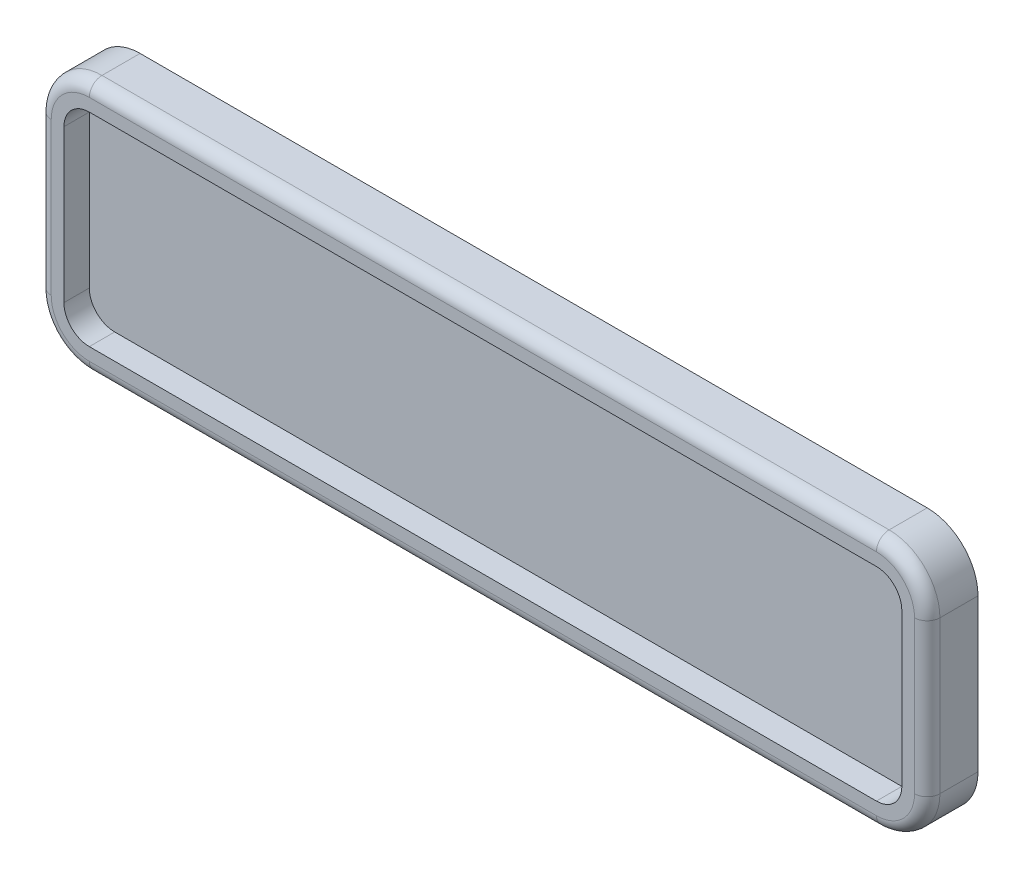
from build123d import *

# Parameters (mm, degrees)
BOSS_EXTRUDE1_DEPTH = 2
CUT_EXTRUDE2_DEPTH  = 1
FILLET3_R           = 0.5


with BuildPart() as part:
    # Sketch1 → Boss-Extrude1 (new body)
    with BuildSketch(Plane.XY):
        with BuildLine():
            Line((2, 0), (33, 0))
            ThreePointArc((33, 0), (34.414213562, 0.585786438), (35, 2))
            Line((35, 2), (35, 8))
            ThreePointArc((35, 8), (34.414213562, 9.414213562), (33, 10))
            Line((33, 10), (2, 10))
            ThreePointArc((2, 10), (0.585786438, 9.414213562), (0, 8))
            Line((0, 8), (0, 2))
            ThreePointArc((0, 2), (0.585786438, 0.585786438), (2, 0))
        make_face()
    extrude(amount=BOSS_EXTRUDE1_DEPTH)

    # Sketch2 → Cut-Extrude2 (cut)
    with BuildSketch(Plane.XY.offset(2)):
        with BuildLine():
            Line((33, 9), (2, 9))
            ThreePointArc((2, 9), (1.292893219, 8.707106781), (1, 8))
            Line((1, 8), (1, 2))
            ThreePointArc((1, 2), (1.292893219, 1.292893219), (2, 1))
            Line((2, 1), (33, 1))
            ThreePointArc((33, 1), (33.707106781, 1.292893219), (34, 2))
            Line((34, 2), (34, 8))
            ThreePointArc((34, 8), (33.707106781, 8.707106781), (33, 9))
        make_face()
    extrude(amount=-CUT_EXTRUDE2_DEPTH, mode=Mode.SUBTRACT)

    # Fillet3
    fillet3_edges = [part.edges().sort_by_distance(p)[0] for p in [
        (0.585786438, 9.414213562, 2),
        (0, 5, 2),
        (0.585786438, 0.585786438, 2),
        (17.5, 0, 2),
        (34.414213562, 0.585786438, 2),
        (35, 5, 2),
        (34.414213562, 9.414213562, 2),
        (17.5, 10, 2),
    ]]
    fillet(fillet3_edges, radius=FILLET3_R)


solid = part.part
